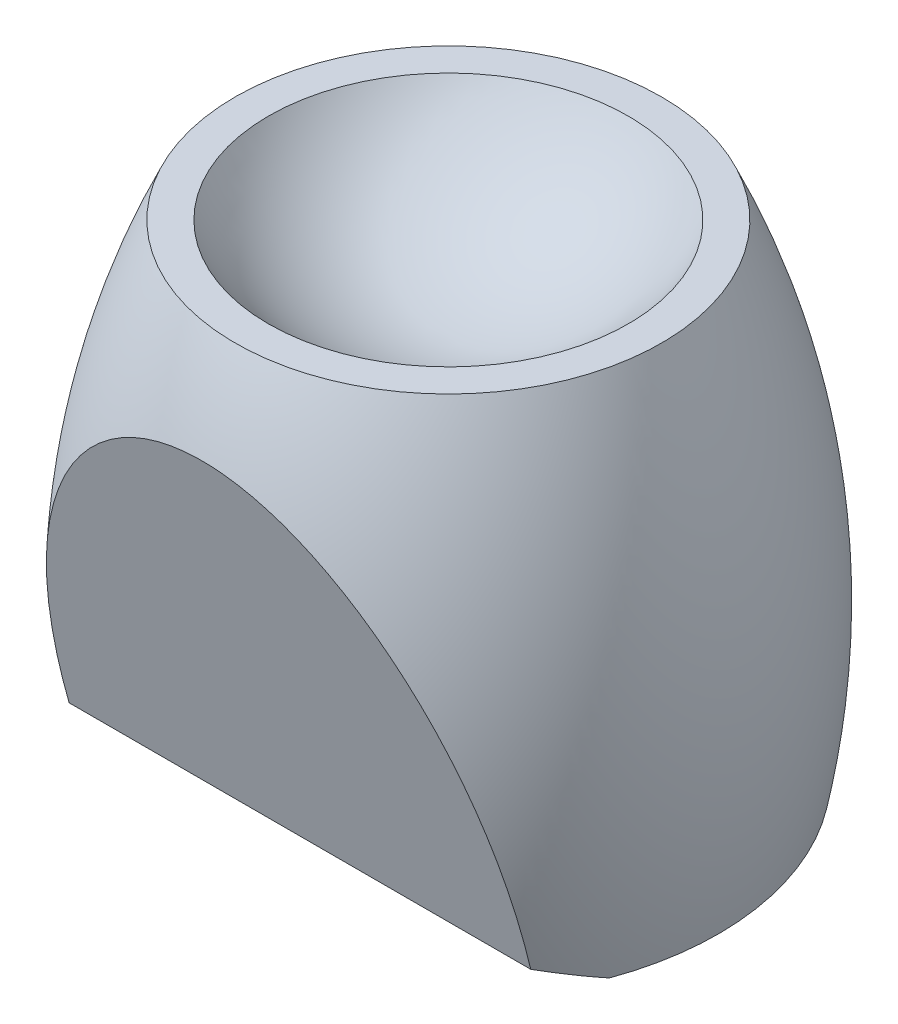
ISO-10303-21;
HEADER;
FILE_DESCRIPTION(('STEP AP214'),'2;1');
FILE_NAME('part.step','',(''),(''),'','','');
FILE_SCHEMA(('AUTOMOTIVE_DESIGN { 1 0 10303 214 1 1 1 1 }'));
ENDSEC;
DATA;
#1=APPLICATION_CONTEXT('core data for automotive mechanical design processes');
#2=APPLICATION_PROTOCOL_DEFINITION('international standard','automotive_design',2000,#1);
#3=PRODUCT_CONTEXT('',#1,'mechanical');
#4=PRODUCT('Part','Part','',(#3));
#5=PRODUCT_RELATED_PRODUCT_CATEGORY('part','',(#4));
#6=PRODUCT_DEFINITION_FORMATION('','',#4);
#7=PRODUCT_DEFINITION_CONTEXT('part definition',#1,'design');
#8=PRODUCT_DEFINITION('design','',#6,#7);
#9=PRODUCT_DEFINITION_SHAPE('','',#8);
#10=(LENGTH_UNIT() NAMED_UNIT(*) SI_UNIT(.MILLI.,.METRE.));
#11=(NAMED_UNIT(*) PLANE_ANGLE_UNIT() SI_UNIT($,.RADIAN.));
#12=(NAMED_UNIT(*) SI_UNIT($,.STERADIAN.) SOLID_ANGLE_UNIT());
#13=UNCERTAINTY_MEASURE_WITH_UNIT(LENGTH_MEASURE(1.E-05),#10,'distance_accuracy_value','');
#14=(GEOMETRIC_REPRESENTATION_CONTEXT(3) GLOBAL_UNCERTAINTY_ASSIGNED_CONTEXT((#13)) GLOBAL_UNIT_ASSIGNED_CONTEXT((#10,
#11,#12)) REPRESENTATION_CONTEXT('',''));
#15=CARTESIAN_POINT('',(0.,0.,0.));
#16=DIRECTION('',(0.,0.,1.));
#17=DIRECTION('',(1.,0.,0.));
#18=AXIS2_PLACEMENT_3D('',#15,#16,#17);
#19=CARTESIAN_POINT('',(0.,195.5,0.));
#20=DIRECTION('',(0.,1.,0.));
#21=DIRECTION('',(0.,0.,1.));
#22=AXIS2_PLACEMENT_3D('',#19,#20,#21);
#23=PLANE('',#22);
#24=CARTESIAN_POINT('',(0.,195.5,0.));
#25=DIRECTION('',(0.,-1.,0.));
#26=DIRECTION('',(0.,0.,-1.));
#27=AXIS2_PLACEMENT_3D('',#24,#25,#26);
#28=CIRCLE('',#27,86.25);
#29=CARTESIAN_POINT('',(0.,195.5,-86.25));
#30=VERTEX_POINT('',#29);
#31=EDGE_CURVE('E88',#30,#30,#28,.T.);
#32=ORIENTED_EDGE('',*,*,#31,.F.);
#33=EDGE_LOOP('',(#32));
#34=FACE_BOUND('',#33,.T.);
#35=CARTESIAN_POINT('',(0.,195.5,0.));
#36=DIRECTION('',(0.,1.,0.));
#37=DIRECTION('',(0.,0.,1.));
#38=AXIS2_PLACEMENT_3D('',#35,#36,#37);
#39=CIRCLE('',#38,72.8010988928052);
#40=CARTESIAN_POINT('',(0.,195.5,72.8010988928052));
#41=VERTEX_POINT('',#40);
#42=EDGE_CURVE('E126',#41,#41,#39,.F.);
#43=ORIENTED_EDGE('',*,*,#42,.T.);
#44=EDGE_LOOP('',(#43));
#45=FACE_BOUND('',#44,.T.);
#46=ADVANCED_FACE('F37',(#34,#45),#23,.T.);
#47=CARTESIAN_POINT('',(0.,0.,0.));
#48=DIRECTION('',(0.,-1.,0.));
#49=DIRECTION('',(0.,0.,-1.));
#50=AXIS2_PLACEMENT_3D('',#47,#48,#49);
#51=PLANE('',#50);
#52=CARTESIAN_POINT('',(-74.75,0.,0.));
#53=DIRECTION('',(0.,-1.,0.));
#54=DIRECTION('',(0.,0.,-1.));
#55=AXIS2_PLACEMENT_3D('',#52,#53,#54);
#56=CIRCLE('',#55,31.4940470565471);
#57=CARTESIAN_POINT('',(-74.75,0.,-31.4940470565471));
#58=VERTEX_POINT('',#57);
#59=EDGE_CURVE('E128',#58,#58,#56,.T.);
#60=ORIENTED_EDGE('',*,*,#59,.F.);
#61=EDGE_LOOP('',(#60));
#62=FACE_BOUND('',#61,.T.);
#63=CARTESIAN_POINT('',(74.75,0.,0.));
#64=DIRECTION('',(0.,-1.,0.));
#65=DIRECTION('',(0.,0.,-1.));
#66=AXIS2_PLACEMENT_3D('',#63,#64,#65);
#67=CIRCLE('',#66,31.4940470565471);
#68=CARTESIAN_POINT('',(74.75,0.,-31.4940470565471));
#69=VERTEX_POINT('',#68);
#70=EDGE_CURVE('E78',#69,#69,#67,.T.);
#71=ORIENTED_EDGE('',*,*,#70,.F.);
#72=EDGE_LOOP('',(#71));
#73=FACE_BOUND('',#72,.T.);
#74=CARTESIAN_POINT('',(0.,1.11022302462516E-13,0.));
#75=DIRECTION('',(0.,-1.,0.));
#76=DIRECTION('',(0.,0.,-1.));
#77=AXIS2_PLACEMENT_3D('',#74,#75,#76);
#78=CIRCLE('',#77,109.25);
#79=CARTESIAN_POINT('',(58.4945810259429,0.,-92.2710490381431));
#80=VERTEX_POINT('',#79);
#81=CARTESIAN_POINT('',(102.612438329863,1.11022302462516E-13,37.4999999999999));
#82=VERTEX_POINT('',#81);
#83=EDGE_CURVE('E67',#80,#82,#78,.T.);
#84=ORIENTED_EDGE('',*,*,#83,.T.);
#85=DIRECTION('',(-1.,0.,0.));
#86=VECTOR('',#85,1.);
#87=CARTESIAN_POINT('',(-92.8940929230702,0.,37.4999999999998));
#88=LINE('',#87,#86);
#89=CARTESIAN_POINT('',(-102.612438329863,1.11022302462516E-13,37.4999999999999));
#90=VERTEX_POINT('',#89);
#91=EDGE_CURVE('E12',#82,#90,#88,.T.);
#92=ORIENTED_EDGE('',*,*,#91,.T.);
#93=CARTESIAN_POINT('',(-58.494581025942,1.11022302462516E-13,-92.2710490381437));
#94=VERTEX_POINT('',#93);
#95=EDGE_CURVE('E74',#90,#94,#78,.T.);
#96=ORIENTED_EDGE('',*,*,#95,.T.);
#97=DIRECTION('',(-1.,0.,0.));
#98=VECTOR('',#97,1.);
#99=CARTESIAN_POINT('',(4.70915201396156E-13,0.,-92.2710490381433));
#100=LINE('',#99,#98);
#101=EDGE_CURVE('E75',#80,#94,#100,.T.);
#102=ORIENTED_EDGE('',*,*,#101,.F.);
#103=EDGE_LOOP('',(#84,#92,#96,#102));
#104=FACE_BOUND('',#103,.T.);
#105=ADVANCED_FACE('F39',(#62,#73,#104),#51,.T.);
#106=CARTESIAN_POINT('',(0.,62.1732910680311,0.));
#107=DIRECTION('',(0.,-1.,0.));
#108=DIRECTION('',(0.,0.,-1.));
#109=AXIS2_PLACEMENT_3D('',#106,#107,#108);
#110=DEGENERATE_TOROIDAL_SURFACE('',#109,204.652025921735,320.,.F.);
#111=CARTESIAN_POINT('',(92.8940787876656,-0.000199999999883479,57.4999475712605));
#112=CARTESIAN_POINT('',(93.1230866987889,3.240362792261,58.3494406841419));
#113=CARTESIAN_POINT('',(93.2852853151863,6.48545906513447,59.2001222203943));
#114=CARTESIAN_POINT('',(93.4731677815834,12.9797125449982,60.9025498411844));
#115=CARTESIAN_POINT('',(93.4988355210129,16.2288701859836,61.7542960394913));
#116=CARTESIAN_POINT('',(93.4106126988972,22.7322503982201,63.4591161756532));
#117=CARTESIAN_POINT('',(93.2964308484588,25.986469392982,64.3121891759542));
#118=CARTESIAN_POINT('',(92.9248297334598,32.4871743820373,66.0163080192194));
#119=CARTESIAN_POINT('',(92.6674155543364,35.7336606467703,66.8673539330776));
#120=CARTESIAN_POINT('',(92.0023277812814,42.2475595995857,68.5749314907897));
#121=CARTESIAN_POINT('',(91.5930665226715,45.5148213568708,69.4314235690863));
#122=CARTESIAN_POINT('',(90.6206943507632,52.0280936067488,71.138836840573));
#123=CARTESIAN_POINT('',(90.0575763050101,55.2741031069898,71.9897577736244));
#124=CARTESIAN_POINT('',(88.7737081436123,61.7336727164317,73.6830932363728));
#125=CARTESIAN_POINT('',(88.0531085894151,64.9472607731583,74.5255150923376));
#126=CARTESIAN_POINT('',(86.449047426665,71.3359951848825,76.2002815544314));
#127=CARTESIAN_POINT('',(85.5656077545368,74.5111466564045,77.032627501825));
#128=CARTESIAN_POINT('',(84.022745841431,79.5347995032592,78.3495464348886));
#129=CARTESIAN_POINT('',(83.4177802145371,81.39908674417,78.8382575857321));
#130=CARTESIAN_POINT('',(82.1469583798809,85.1081097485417,79.8105545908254));
#131=CARTESIAN_POINT('',(81.4811050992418,86.9528464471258,80.2941406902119));
#132=CARTESIAN_POINT('',(80.0870050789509,90.6202707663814,81.2555328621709));
#133=CARTESIAN_POINT('',(79.3587544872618,92.4429570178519,81.7333385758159));
#134=CARTESIAN_POINT('',(77.8382966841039,96.0632516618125,82.6823760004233));
#135=CARTESIAN_POINT('',(77.0460888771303,97.8608598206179,83.1536076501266));
#136=CARTESIAN_POINT('',(75.3983540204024,101.42258158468,84.0872905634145));
#137=CARTESIAN_POINT('',(74.543014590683,103.186776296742,84.5497630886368));
#138=CARTESIAN_POINT('',(72.7651514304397,106.683279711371,85.4663494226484));
#139=CARTESIAN_POINT('',(71.8426265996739,108.415587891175,85.9204630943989));
#140=CARTESIAN_POINT('',(69.928622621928,111.843674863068,86.8191144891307));
#141=CARTESIAN_POINT('',(68.9371616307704,113.53946312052,87.2636546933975));
#142=CARTESIAN_POINT('',(66.8829988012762,116.890013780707,88.1419804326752));
#143=CARTESIAN_POINT('',(65.8203020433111,118.544779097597,88.5757667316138));
#144=CARTESIAN_POINT('',(63.1720907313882,122.474533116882,89.6059269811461));
#145=CARTESIAN_POINT('',(61.5503049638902,124.726822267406,90.1963503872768));
#146=CARTESIAN_POINT('',(58.1535922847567,129.121453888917,91.3483753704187));
#147=CARTESIAN_POINT('',(56.378662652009,131.263794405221,91.9099764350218));
#148=CARTESIAN_POINT('',(53.5975637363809,134.376192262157,92.725871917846));
#149=CARTESIAN_POINT('',(52.651105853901,135.396459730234,92.9933286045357));
#150=CARTESIAN_POINT('',(50.7175836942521,137.400298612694,93.5186223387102));
#151=CARTESIAN_POINT('',(49.7305186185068,138.383869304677,93.7764591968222));
#152=CARTESIAN_POINT('',(46.7078592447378,141.273462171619,94.5339477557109));
#153=CARTESIAN_POINT('',(44.6097559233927,143.119544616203,95.0178866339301));
#154=CARTESIAN_POINT('',(40.8794863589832,146.107005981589,95.801030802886));
#155=CARTESIAN_POINT('',(39.2889881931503,147.297327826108,96.1130661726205));
#156=CARTESIAN_POINT('',(36.0232500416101,149.564314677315,96.7073424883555));
#157=CARTESIAN_POINT('',(34.3480153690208,150.640986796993,96.9895852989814));
#158=CARTESIAN_POINT('',(30.9171192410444,152.662899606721,97.5196169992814));
#159=CARTESIAN_POINT('',(29.161551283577,153.608288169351,97.76744465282));
#160=CARTESIAN_POINT('',(25.5734480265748,155.351144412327,98.2243234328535));
#161=CARTESIAN_POINT('',(23.7409268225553,156.14863903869,98.4333816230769));
#162=CARTESIAN_POINT('',(20.3248215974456,157.456280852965,98.7761716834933));
#163=CARTESIAN_POINT('',(18.7517789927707,157.992225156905,98.9166661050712));
#164=CARTESIAN_POINT('',(15.566128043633,158.939889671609,99.1650903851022));
#165=CARTESIAN_POINT('',(13.953523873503,159.351622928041,99.2730236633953));
#166=CARTESIAN_POINT('',(10.6990837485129,160.042207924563,99.4540561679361));
#167=CARTESIAN_POINT('',(9.05726619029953,160.32114042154,99.5271765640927));
#168=CARTESIAN_POINT('',(5.75469412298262,160.740243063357,99.6370416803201));
#169=CARTESIAN_POINT('',(4.09393946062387,160.880412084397,99.6737861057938));
#170=CARTESIAN_POINT('',(0.762015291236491,161.018823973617,99.7100699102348));
#171=CARTESIAN_POINT('',(-0.909169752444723,161.016718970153,99.709518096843));
#172=CARTESIAN_POINT('',(-4.24478779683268,160.869768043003,99.6709958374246));
#173=CARTESIAN_POINT('',(-5.90922077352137,160.724921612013,99.6330252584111));
#174=CARTESIAN_POINT('',(-9.21932243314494,160.295854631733,99.5205480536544));
#175=CARTESIAN_POINT('',(-10.8649836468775,160.011580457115,99.446027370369));
#176=CARTESIAN_POINT('',(-14.1256038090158,159.310029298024,99.2621201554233));
#177=CARTESIAN_POINT('',(-15.7405622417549,158.892750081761,99.152733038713));
#178=CARTESIAN_POINT('',(-18.8893403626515,157.946123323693,98.9045808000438));
#179=CARTESIAN_POINT('',(-20.424178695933,157.419928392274,98.7666421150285));
#180=CARTESIAN_POINT('',(-23.4489237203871,156.258663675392,98.4622238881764));
#181=CARTESIAN_POINT('',(-24.9388323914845,155.623598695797,98.2957456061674));
#182=CARTESIAN_POINT('',(-27.8689878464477,154.254200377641,97.9367664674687));
#183=CARTESIAN_POINT('',(-29.3092323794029,153.519862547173,97.7442644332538));
#184=CARTESIAN_POINT('',(-32.1373652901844,151.961235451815,97.3356801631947));
#185=CARTESIAN_POINT('',(-33.5252276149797,151.13690219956,97.1195863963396));
#186=CARTESIAN_POINT('',(-37.0783998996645,148.878705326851,96.5276143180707));
#187=CARTESIAN_POINT('',(-39.2001373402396,147.380365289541,96.1348339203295));
#188=CARTESIAN_POINT('',(-43.2986130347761,144.209148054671,95.3035193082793));
#189=CARTESIAN_POINT('',(-45.2753284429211,142.536243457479,94.8649779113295));
#190=CARTESIAN_POINT('',(-48.1353782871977,139.915934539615,94.1780804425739));
#191=CARTESIAN_POINT('',(-49.0724676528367,139.022671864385,93.9439172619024));
#192=CARTESIAN_POINT('',(-50.9109478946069,137.203029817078,93.4669095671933));
#193=CARTESIAN_POINT('',(-51.8123512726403,136.27666226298,93.2240681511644));
#194=CARTESIAN_POINT('',(-54.4645681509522,133.4516252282,92.4835024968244));
#195=CARTESIAN_POINT('',(-56.1634371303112,131.506976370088,91.9737250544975));
#196=CARTESIAN_POINT('',(-59.0411781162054,127.987702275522,91.0511695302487));
#197=CARTESIAN_POINT('',(-60.2480520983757,126.434249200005,90.6439415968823));
#198=CARTESIAN_POINT('',(-62.5863467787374,123.274863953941,89.8157286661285));
#199=CARTESIAN_POINT('',(-63.7177614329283,121.668927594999,89.3947425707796));
#200=CARTESIAN_POINT('',(-65.9078142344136,118.410424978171,88.5405466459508));
#201=CARTESIAN_POINT('',(-66.9664211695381,116.757839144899,88.1073316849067));
#202=CARTESIAN_POINT('',(-69.0126369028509,113.412144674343,87.2302789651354));
#203=CARTESIAN_POINT('',(-70.0002471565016,111.719036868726,86.7864414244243));
#204=CARTESIAN_POINT('',(-71.9079063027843,108.294748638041,85.8887858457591));
#205=CARTESIAN_POINT('',(-72.8278643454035,106.563520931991,85.4349554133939));
#206=CARTESIAN_POINT('',(-74.6007896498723,103.06932131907,84.5189730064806));
#207=CARTESIAN_POINT('',(-75.4537572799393,101.306349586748,84.0568210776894));
#208=CARTESIAN_POINT('',(-77.094475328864,97.7525060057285,83.1252033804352));
#209=CARTESIAN_POINT('',(-77.8822331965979,95.9616373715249,82.6557384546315));
#210=CARTESIAN_POINT('',(-79.39436397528,92.3550058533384,81.7102827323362));
#211=CARTESIAN_POINT('',(-80.1187340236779,90.5392418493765,81.2342916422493));
#212=CARTESIAN_POINT('',(-81.8177033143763,86.063704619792,80.0610577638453));
#213=CARTESIAN_POINT('',(-82.7582422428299,83.3917771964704,79.3606288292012));
#214=CARTESIAN_POINT('',(-84.5136506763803,78.0094928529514,77.9496969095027));
#215=CARTESIAN_POINT('',(-85.3285091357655,75.2991325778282,77.2391930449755));
#216=CARTESIAN_POINT('',(-86.8366214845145,69.8457106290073,75.80961285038));
#217=CARTESIAN_POINT('',(-87.5298218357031,67.10263512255,75.0905328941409));
#218=CARTESIAN_POINT('',(-88.7975337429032,61.5910981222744,73.6457182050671));
#219=CARTESIAN_POINT('',(-89.3720485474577,58.8226373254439,72.9199836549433));
#220=CARTESIAN_POINT('',(-90.4053196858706,53.2662866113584,71.4634213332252));
#221=CARTESIAN_POINT('',(-90.8641047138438,50.4784016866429,70.7325948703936));
#222=CARTESIAN_POINT('',(-91.6688128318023,44.8876026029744,69.2670021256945));
#223=CARTESIAN_POINT('',(-92.0147341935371,42.0846882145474,68.5322357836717));
#224=CARTESIAN_POINT('',(-92.8866571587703,33.6627222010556,66.3244704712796));
#225=CARTESIAN_POINT('',(-93.2474945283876,28.0267595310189,64.8470383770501));
#226=CARTESIAN_POINT('',(-93.4954247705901,18.6486087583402,62.3886152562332));
#227=CARTESIAN_POINT('',(-93.5012379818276,14.9086894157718,61.4082189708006));
#228=CARTESIAN_POINT('',(-93.3740474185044,9.3074885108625,59.9398994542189));
#229=CARTESIAN_POINT('',(-93.3091981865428,7.44466625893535,59.4515723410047));
#230=CARTESIAN_POINT('',(-93.1349365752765,3.72068251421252,58.4753534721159));
#231=CARTESIAN_POINT('',(-93.0255173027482,1.85952132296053,57.9874617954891));
#232=CARTESIAN_POINT('',(-92.8940787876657,-0.000199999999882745,57.4999475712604));
#233=B_SPLINE_CURVE_WITH_KNOTS('',3,(#111,#112,#113,#114,#115,#116,#117,#118,#119,#120,#121,
#122,#123,#124,#125,#126,#127,#128,#129,#130,#131,#132,#133,#134,#135,#136,#137,#138,#139,#140,
#141,#142,#143,#144,#145,#146,#147,#148,#149,#150,#151,#152,#153,#154,#155,#156,#157,#158,#159,
#160,#161,#162,#163,#164,#165,#166,#167,#168,#169,#170,#171,#172,#173,#174,#175,#176,#177,#178,
#179,#180,#181,#182,#183,#184,#185,#186,#187,#188,#189,#190,#191,#192,#193,#194,#195,#196,#197,
#198,#199,#200,#201,#202,#203,#204,#205,#206,#207,#208,#209,#210,#211,#212,#213,#214,#215,#216,
#217,#218,#219,#220,#221,#222,#223,#224,#225,#226,#227,#228,#229,#230,#231,#232),.UNSPECIFIED.,
.F.,.F.,(4,2,2,2,2,2,2,2,2,2,2,2,2,2,2,2,2,2,2,2,2,2,2,2,2,2,2,2,2,2,2,2,2,2,2,2,2,2,2,2,2,2,2,
2,2,2,2,2,2,2,2,2,2,2,2,2,2,2,2,2,4),(0.,10.0731365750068,20.1474617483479,30.2428061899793,
40.3377922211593,50.5414474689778,60.7455758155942,70.9399907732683,81.1330334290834,
87.1921458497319,93.2509671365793,99.3101627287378,105.369414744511,111.411333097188,
117.453350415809,123.493782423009,129.53378409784,138.040518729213,146.547404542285,
150.797812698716,155.048304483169,163.544484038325,169.572937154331,175.601012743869,
181.622242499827,187.642374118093,192.640680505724,197.638461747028,202.633199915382,
207.62797853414,212.634970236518,217.641979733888,222.650916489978,227.659937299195,
232.540344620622,237.420536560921,242.300949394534,247.183758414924,255.052486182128,
262.922450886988,266.868545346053,270.813244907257,278.702442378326,284.727077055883,
290.752193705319,296.779877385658,302.807437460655,308.842949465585,314.878428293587,
320.913216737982,326.948277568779,335.698792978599,344.45007700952,353.205202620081,
361.96008856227,370.712801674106,379.465648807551,396.959755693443,408.554675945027,
414.334755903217,420.115730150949),.UNSPECIFIED.);
#234=CARTESIAN_POINT('',(93.3774997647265,9.67315551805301,60.0357567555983));
#235=VERTEX_POINT('',#234);
#236=CARTESIAN_POINT('',(-93.3774997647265,9.67315551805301,60.0357567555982));
#237=VERTEX_POINT('',#236);
#238=EDGE_CURVE('E82',#235,#237,#233,.T.);
#239=ORIENTED_EDGE('',*,*,#238,.F.);
#240=CARTESIAN_POINT('',(93.3774997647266,9.67315551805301,60.0357567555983));
#241=CARTESIAN_POINT('',(93.877624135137,9.28848422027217,59.1395798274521));
#242=CARTESIAN_POINT('',(94.3636954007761,8.90099855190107,58.2368462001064));
#243=CARTESIAN_POINT('',(95.3075023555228,8.12069899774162,56.4189656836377));
#244=CARTESIAN_POINT('',(95.76523829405,7.7278851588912,55.5038189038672));
#245=CARTESIAN_POINT('',(97.0926956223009,6.5444917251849,52.7468419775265));
#246=CARTESIAN_POINT('',(97.9199577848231,5.74642652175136,50.8875724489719));
#247=CARTESIAN_POINT('',(99.4589168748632,4.13318575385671,47.1291710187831));
#248=CARTESIAN_POINT('',(100.170611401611,3.31800983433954,45.2300382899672));
#249=CARTESIAN_POINT('',(101.479119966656,1.67056821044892,41.391958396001));
#250=CARTESIAN_POINT('',(102.07555903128,0.838256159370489,39.4529032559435));
#251=CARTESIAN_POINT('',(102.612438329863,0.,37.4999999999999));
#252=B_SPLINE_CURVE_WITH_KNOTS('',3,(#240,#241,#242,#243,#244,#245,#246,#247,#248,#249,#250,
#251),.UNSPECIFIED.,.F.,.F.,(4,2,2,2,2,4),(0.,3.28778006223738,6.5755311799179,13.129412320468,
19.683429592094,26.2584234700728),.UNSPECIFIED.);
#253=EDGE_CURVE('E45',#235,#82,#252,.T.);
#254=ORIENTED_EDGE('',*,*,#253,.T.);
#255=ORIENTED_EDGE('',*,*,#83,.F.);
#256=CARTESIAN_POINT('',(-58.4948225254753,-0.000199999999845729,-92.2708490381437));
#257=CARTESIAN_POINT('',(-57.7529253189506,0.614207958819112,-92.8852569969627));
#258=CARTESIAN_POINT('',(-56.9955087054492,1.21918204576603,-93.4902310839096));
#259=CARTESIAN_POINT('',(-55.4497540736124,2.40913769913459,-94.6801867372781));
#260=CARTESIAN_POINT('',(-54.6614133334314,2.99411749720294,-95.2651665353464));
#261=CARTESIAN_POINT('',(-52.2494717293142,4.71786795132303,-96.9889169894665));
#262=CARTESIAN_POINT('',(-50.5797918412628,5.82475136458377,-98.0958004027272));
#263=CARTESIAN_POINT('',(-47.1114913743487,7.94885892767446,-100.219907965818));
#264=CARTESIAN_POINT('',(-45.3121382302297,8.96548720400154,-101.236536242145));
#265=CARTESIAN_POINT('',(-42.5288924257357,10.4084783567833,-102.679527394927));
#266=CARTESIAN_POINT('',(-41.5870843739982,10.8758270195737,-103.146876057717));
#267=CARTESIAN_POINT('',(-39.6763140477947,11.7818447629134,-104.052893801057));
#268=CARTESIAN_POINT('',(-38.7073544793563,12.2205166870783,-104.491565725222));
#269=CARTESIAN_POINT('',(-36.7384320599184,13.0699170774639,-105.340966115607));
#270=CARTESIAN_POINT('',(-35.7383359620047,13.4804911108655,-105.751540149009));
#271=CARTESIAN_POINT('',(-33.7134020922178,14.2697366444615,-106.540785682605));
#272=CARTESIAN_POINT('',(-32.6885671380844,14.6484117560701,-106.919460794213));
#273=CARTESIAN_POINT('',(-30.6154241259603,15.3725742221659,-107.643623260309));
#274=CARTESIAN_POINT('',(-29.5671111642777,15.7180545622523,-107.989103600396));
#275=CARTESIAN_POINT('',(-27.4491328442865,16.3743416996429,-108.645390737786));
#276=CARTESIAN_POINT('',(-26.3794700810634,16.6851526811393,-108.956201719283));
#277=CARTESIAN_POINT('',(-24.223571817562,17.2700752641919,-109.541124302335));
#278=CARTESIAN_POINT('',(-23.1373890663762,17.5442840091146,-109.815333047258));
#279=CARTESIAN_POINT('',(-20.9479082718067,18.0557861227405,-110.326835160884));
#280=CARTESIAN_POINT('',(-19.8446123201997,18.2930839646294,-110.564133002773));
#281=CARTESIAN_POINT('',(-17.6231483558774,18.729739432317,-111.00078847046));
#282=CARTESIAN_POINT('',(-16.504980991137,18.9290987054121,-111.200147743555));
#283=CARTESIAN_POINT('',(-14.2562215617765,19.288969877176,-111.560018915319));
#284=CARTESIAN_POINT('',(-13.125629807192,19.4494827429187,-111.720531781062));
#285=CARTESIAN_POINT('',(-10.9617961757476,19.7176291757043,-111.988678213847));
#286=CARTESIAN_POINT('',(-9.92943387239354,19.828823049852,-112.099872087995));
#287=CARTESIAN_POINT('',(-7.8585841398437,20.0183033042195,-112.289352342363));
#288=CARTESIAN_POINT('',(-6.82009618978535,20.096586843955,-112.367635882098));
#289=CARTESIAN_POINT('',(-4.73933781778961,20.2199066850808,-112.490955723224));
#290=CARTESIAN_POINT('',(-3.69706799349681,20.2649480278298,-112.535997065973));
#291=CARTESIAN_POINT('',(-1.61060301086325,20.3216237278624,-112.592672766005));
#292=CARTESIAN_POINT('',(-0.566407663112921,20.3332546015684,-112.604303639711));
#293=CARTESIAN_POINT('',(1.52189774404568,20.3230503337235,-112.594099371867));
#294=CARTESIAN_POINT('',(2.56600772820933,20.301207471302,-112.572256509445));
#295=CARTESIAN_POINT('',(4.65186892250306,20.2241276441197,-112.495176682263));
#296=CARTESIAN_POINT('',(5.6936198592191,20.1688869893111,-112.439936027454));
#297=CARTESIAN_POINT('',(7.77241130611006,20.0252366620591,-112.296285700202));
#298=CARTESIAN_POINT('',(8.80945242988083,19.9368314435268,-112.20788048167));
#299=CARTESIAN_POINT('',(10.8769106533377,19.7272148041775,-111.998263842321));
#300=CARTESIAN_POINT('',(11.9073271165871,19.6060002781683,-111.877049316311));
#301=CARTESIAN_POINT('',(14.8495673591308,19.2120204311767,-111.48306946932));
#302=CARTESIAN_POINT('',(16.7509147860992,18.8989829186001,-111.170031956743));
#303=CARTESIAN_POINT('',(20.5106828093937,18.1642471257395,-110.435296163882));
#304=CARTESIAN_POINT('',(22.3691056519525,17.7425545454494,-110.013603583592));
#305=CARTESIAN_POINT('',(26.0326797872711,16.7957274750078,-109.066776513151));
#306=CARTESIAN_POINT('',(27.8378249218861,16.2705810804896,-108.541630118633));
#307=CARTESIAN_POINT('',(31.385072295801,15.123039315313,-107.394088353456));
#308=CARTESIAN_POINT('',(33.127172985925,14.500641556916,-106.771690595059));
#309=CARTESIAN_POINT('',(36.6354266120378,13.1281272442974,-105.39917628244));
#310=CARTESIAN_POINT('',(38.3975237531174,12.3728309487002,-104.643879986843));
#311=CARTESIAN_POINT('',(41.8353044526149,10.769489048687,-103.04053808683));
#312=CARTESIAN_POINT('',(43.5109771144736,9.92143179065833,-102.192480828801));
#313=CARTESIAN_POINT('',(46.7690068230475,8.14148340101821,-100.412532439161));
#314=CARTESIAN_POINT('',(48.3514162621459,7.20964009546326,-99.4806891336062));
#315=CARTESIAN_POINT('',(51.4193838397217,5.27006692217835,-97.5411159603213));
#316=CARTESIAN_POINT('',(52.9049742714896,4.26236260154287,-96.5334116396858));
#317=CARTESIAN_POINT('',(55.0586364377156,2.69982819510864,-94.9708772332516));
#318=CARTESIAN_POINT('',(55.7640805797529,2.17047821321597,-94.4415272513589));
#319=CARTESIAN_POINT('',(57.1487726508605,1.0965412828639,-93.3675903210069));
#320=CARTESIAN_POINT('',(57.8280626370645,0.551981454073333,-92.8230304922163));
#321=CARTESIAN_POINT('',(58.4948225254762,-0.000199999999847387,-92.2708490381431));
#322=B_SPLINE_CURVE_WITH_KNOTS('',3,(#256,#257,#258,#259,#260,#261,#262,#263,#264,#265,#266,
#267,#268,#269,#270,#271,#272,#273,#274,#275,#276,#277,#278,#279,#280,#281,#282,#283,#284,#285,
#286,#287,#288,#289,#290,#291,#292,#293,#294,#295,#296,#297,#298,#299,#300,#301,#302,#303,#304,
#305,#306,#307,#308,#309,#310,#311,#312,#313,#314,#315,#316,#317,#318,#319,#320,#321),
.UNSPECIFIED.,.F.,.F.,(4,2,2,2,2,2,2,2,2,2,2,2,2,2,2,2,2,2,2,2,2,2,2,2,2,2,2,2,2,2,2,2,4),(0.,
3.42728911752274,6.85488057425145,13.7139437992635,20.6153631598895,24.0662372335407,
27.5167685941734,30.9849520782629,34.452742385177,37.9212638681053,41.3893662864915,
44.8480730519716,48.3063603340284,51.7644974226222,55.2225484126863,58.3543294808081,
61.4863807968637,64.6179570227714,67.7498597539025,70.8824849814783,74.0154563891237,
77.1480071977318,80.2808545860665,86.1302397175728,91.9793180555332,97.8290698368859,
103.67896526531,109.854378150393,116.03056774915,122.203254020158,128.373870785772,
131.459277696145,134.539496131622),.UNSPECIFIED.);
#323=EDGE_CURVE('E72',#94,#80,#322,.T.);
#324=ORIENTED_EDGE('',*,*,#323,.F.);
#325=ORIENTED_EDGE('',*,*,#95,.F.);
#326=CARTESIAN_POINT('',(-102.612438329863,0.,37.4999999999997));
#327=CARTESIAN_POINT('',(-102.07555903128,0.838256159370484,39.4529032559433));
#328=CARTESIAN_POINT('',(-101.479119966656,1.67056821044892,41.3919583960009));
#329=CARTESIAN_POINT('',(-100.170611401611,3.31800983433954,45.2300382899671));
#330=CARTESIAN_POINT('',(-99.4589168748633,4.13318575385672,47.129171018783));
#331=CARTESIAN_POINT('',(-97.9199577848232,5.74642652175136,50.8875724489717));
#332=CARTESIAN_POINT('',(-97.0926956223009,6.54449172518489,52.7468419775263));
#333=CARTESIAN_POINT('',(-95.76523829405,7.7278851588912,55.5038189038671));
#334=CARTESIAN_POINT('',(-95.3075023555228,8.12069899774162,56.4189656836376));
#335=CARTESIAN_POINT('',(-94.3636954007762,8.90099855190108,58.2368462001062));
#336=CARTESIAN_POINT('',(-93.8776241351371,9.28848422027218,59.139579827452));
#337=CARTESIAN_POINT('',(-93.3774997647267,9.67315551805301,60.0357567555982));
#338=B_SPLINE_CURVE_WITH_KNOTS('',3,(#326,#327,#328,#329,#330,#331,#332,#333,#334,#335,#336,
#337),.UNSPECIFIED.,.F.,.F.,(4,2,2,2,2,4),(0.,6.57499387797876,13.1290111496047,
19.6828922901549,22.9706434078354,26.2584234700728),.UNSPECIFIED.);
#339=EDGE_CURVE('E85',#90,#237,#338,.T.);
#340=ORIENTED_EDGE('',*,*,#339,.T.);
#341=EDGE_LOOP('',(#239,#254,#255,#324,#325,#340));
#342=FACE_BOUND('',#341,.T.);
#343=ORIENTED_EDGE('',*,*,#31,.T.);
#344=EDGE_LOOP('',(#343));
#345=FACE_BOUND('',#344,.T.);
#346=ADVANCED_FACE('F69',(#342,#345),#110,.F.);
#347=CARTESIAN_POINT('',(0.,-14.1040424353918,53.8027141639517));
#348=DIRECTION('',(0.,0.253575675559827,-0.967315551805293));
#349=DIRECTION('',(0.,0.967315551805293,0.253575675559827));
#350=AXIS2_PLACEMENT_3D('',#347,#348,#349);
#351=PLANE('',#350);
#352=ORIENTED_EDGE('',*,*,#238,.T.);
#353=DIRECTION('',(1.,0.,0.));
#354=VECTOR('',#353,1.);
#355=CARTESIAN_POINT('',(92.8940929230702,9.67315551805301,60.0357567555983));
#356=LINE('',#355,#354);
#357=EDGE_CURVE('E81',#237,#235,#356,.T.);
#358=ORIENTED_EDGE('',*,*,#357,.T.);
#359=EDGE_LOOP('',(#352,#358));
#360=FACE_BOUND('',#359,.T.);
#361=ADVANCED_FACE('F107',(#360),#351,.F.);
#362=CARTESIAN_POINT('',(2.35457600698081E-13,-46.1355245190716,-46.1355245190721));
#363=DIRECTION('',(0.,0.707106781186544,0.707106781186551));
#364=DIRECTION('',(0.,-0.707106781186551,0.707106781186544));
#365=AXIS2_PLACEMENT_3D('',#362,#363,#364);
#366=PLANE('',#365);
#367=ORIENTED_EDGE('',*,*,#323,.T.);
#368=ORIENTED_EDGE('',*,*,#101,.T.);
#369=EDGE_LOOP('',(#367,#368));
#370=FACE_BOUND('',#369,.T.);
#371=ADVANCED_FACE('F80',(#370),#366,.F.);
#372=CARTESIAN_POINT('',(74.75,-37.3749999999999,0.));
#373=DIRECTION('',(0.,-1.,0.));
#374=DIRECTION('',(1.,0.,0.));
#375=AXIS2_PLACEMENT_3D('',#372,#373,#374);
#376=SPHERICAL_SURFACE('',#375,48.875);
#377=ORIENTED_EDGE('',*,*,#70,.T.);
#378=EDGE_LOOP('',(#377));
#379=FACE_BOUND('',#378,.T.);
#380=ADVANCED_FACE('F106',(#379),#376,.F.);
#381=CARTESIAN_POINT('',(-74.75,-37.3749999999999,0.));
#382=DIRECTION('',(0.,-1.,0.));
#383=DIRECTION('',(-1.,0.,0.));
#384=AXIS2_PLACEMENT_3D('',#381,#382,#383);
#385=SPHERICAL_SURFACE('',#384,48.875);
#386=ORIENTED_EDGE('',*,*,#59,.T.);
#387=EDGE_LOOP('',(#386));
#388=FACE_BOUND('',#387,.T.);
#389=ADVANCED_FACE('F147',(#388),#385,.F.);
#390=CARTESIAN_POINT('',(0.,241.75,0.));
#391=DIRECTION('',(0.,-1.,0.));
#392=DIRECTION('',(-1.,0.,0.));
#393=AXIS2_PLACEMENT_3D('',#390,#391,#392);
#394=SPHERICAL_SURFACE('',#393,86.25);
#395=ORIENTED_EDGE('',*,*,#42,.F.);
#396=EDGE_LOOP('',(#395));
#397=FACE_BOUND('',#396,.T.);
#398=ADVANCED_FACE('F143',(#397),#394,.F.);
#399=CARTESIAN_POINT('',(0.,9.673155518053,60.0357567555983));
#400=DIRECTION('',(0.,-0.91892381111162,0.394435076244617));
#401=DIRECTION('',(0.,-0.394435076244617,-0.91892381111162));
#402=AXIS2_PLACEMENT_3D('',#399,#400,#401);
#403=PLANE('',#402);
#404=ORIENTED_EDGE('',*,*,#339,.F.);
#405=ORIENTED_EDGE('',*,*,#91,.F.);
#406=ORIENTED_EDGE('',*,*,#253,.F.);
#407=ORIENTED_EDGE('',*,*,#357,.F.);
#408=EDGE_LOOP('',(#404,#405,#406,#407));
#409=FACE_BOUND('',#408,.T.);
#410=ADVANCED_FACE('F139',(#409),#403,.T.);
#411=CLOSED_SHELL('',(#46,#105,#346,#361,#371,#380,#389,#398,#410));
#412=MANIFOLD_SOLID_BREP('B2',#411);
#413=ADVANCED_BREP_SHAPE_REPRESENTATION('',(#18,#412),#14);
#414=SHAPE_DEFINITION_REPRESENTATION(#9,#413);
ENDSEC;
END-ISO-10303-21;
